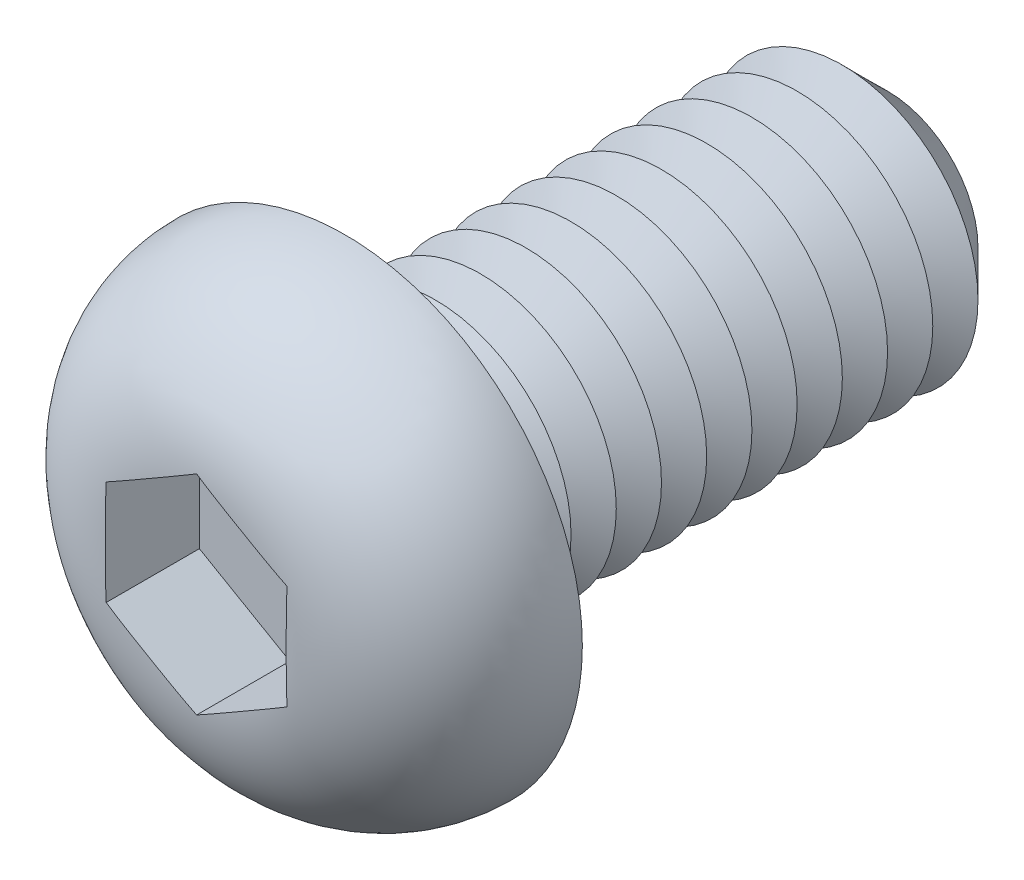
ISO-10303-21;
HEADER;
FILE_DESCRIPTION(('STEP AP214'),'2;1');
FILE_NAME('part.step','',(''),(''),'','','');
FILE_SCHEMA(('AUTOMOTIVE_DESIGN { 1 0 10303 214 1 1 1 1 }'));
ENDSEC;
DATA;
#1=APPLICATION_CONTEXT('core data for automotive mechanical design processes');
#2=APPLICATION_PROTOCOL_DEFINITION('international standard','automotive_design',2000,#1);
#3=PRODUCT_CONTEXT('',#1,'mechanical');
#4=PRODUCT('Part','Part','',(#3));
#5=PRODUCT_RELATED_PRODUCT_CATEGORY('part','',(#4));
#6=PRODUCT_DEFINITION_FORMATION('','',#4);
#7=PRODUCT_DEFINITION_CONTEXT('part definition',#1,'design');
#8=PRODUCT_DEFINITION('design','',#6,#7);
#9=PRODUCT_DEFINITION_SHAPE('','',#8);
#10=(LENGTH_UNIT() NAMED_UNIT(*) SI_UNIT(.MILLI.,.METRE.));
#11=(NAMED_UNIT(*) PLANE_ANGLE_UNIT() SI_UNIT($,.RADIAN.));
#12=(NAMED_UNIT(*) SI_UNIT($,.STERADIAN.) SOLID_ANGLE_UNIT());
#13=UNCERTAINTY_MEASURE_WITH_UNIT(LENGTH_MEASURE(1.E-05),#10,'distance_accuracy_value','');
#14=(GEOMETRIC_REPRESENTATION_CONTEXT(3) GLOBAL_UNCERTAINTY_ASSIGNED_CONTEXT((#13)) GLOBAL_UNIT_ASSIGNED_CONTEXT((#10,
#11,#12)) REPRESENTATION_CONTEXT('',''));
#15=CARTESIAN_POINT('',(0.,0.,0.));
#16=DIRECTION('',(0.,0.,1.));
#17=DIRECTION('',(1.,0.,0.));
#18=AXIS2_PLACEMENT_3D('',#15,#16,#17);
#19=CARTESIAN_POINT('',(0.,0.,-12.));
#20=DIRECTION('',(0.,0.,1.));
#21=DIRECTION('',(1.,0.,0.));
#22=AXIS2_PLACEMENT_3D('',#19,#20,#21);
#23=CYLINDRICAL_SURFACE('',#22,3.);
#24=CARTESIAN_POINT('',(0.,0.,-0.5));
#25=DIRECTION('',(0.,0.,1.));
#26=DIRECTION('',(1.,0.,0.));
#27=AXIS2_PLACEMENT_3D('',#24,#25,#26);
#28=CIRCLE('',#27,3.);
#29=CARTESIAN_POINT('',(3.,0.,-0.5));
#30=VERTEX_POINT('',#29);
#31=EDGE_CURVE('E48',#30,#30,#28,.F.);
#32=ORIENTED_EDGE('',*,*,#31,.T.);
#33=EDGE_LOOP('',(#32));
#34=FACE_BOUND('',#33,.T.);
#35=CARTESIAN_POINT('',(0.,0.,-1.));
#36=DIRECTION('',(0.,0.,1.));
#37=DIRECTION('',(1.,0.,0.));
#38=AXIS2_PLACEMENT_3D('',#35,#36,#37);
#39=CIRCLE('',#38,3.);
#40=CARTESIAN_POINT('',(3.,0.,-1.));
#41=VERTEX_POINT('',#40);
#42=EDGE_CURVE('E118',#41,#41,#39,.T.);
#43=ORIENTED_EDGE('',*,*,#42,.T.);
#44=EDGE_LOOP('',(#43));
#45=FACE_BOUND('',#44,.T.);
#46=ADVANCED_FACE('F39',(#34,#45),#23,.T.);
#47=CARTESIAN_POINT('',(0.,5.25,0.));
#48=DIRECTION('',(0.,0.,1.));
#49=DIRECTION('',(1.,0.,0.));
#50=AXIS2_PLACEMENT_3D('',#47,#48,#49);
#51=PLANE('',#50);
#52=CARTESIAN_POINT('',(0.,0.,0.));
#53=DIRECTION('',(0.,0.,1.));
#54=DIRECTION('',(1.,0.,0.));
#55=AXIS2_PLACEMENT_3D('',#52,#53,#54);
#56=CIRCLE('',#55,3.5);
#57=CARTESIAN_POINT('',(3.5,0.,0.));
#58=VERTEX_POINT('',#57);
#59=EDGE_CURVE('E11',#58,#58,#56,.T.);
#60=ORIENTED_EDGE('',*,*,#59,.T.);
#61=EDGE_LOOP('',(#60));
#62=FACE_BOUND('',#61,.T.);
#63=CARTESIAN_POINT('',(0.,0.,0.));
#64=DIRECTION('',(0.,0.,1.));
#65=DIRECTION('',(1.,0.,0.));
#66=AXIS2_PLACEMENT_3D('',#63,#64,#65);
#67=CIRCLE('',#66,5.25);
#68=CARTESIAN_POINT('',(5.25,0.,0.));
#69=VERTEX_POINT('',#68);
#70=EDGE_CURVE('E141',#69,#69,#67,.T.);
#71=ORIENTED_EDGE('',*,*,#70,.F.);
#72=EDGE_LOOP('',(#71));
#73=FACE_BOUND('',#72,.T.);
#74=ADVANCED_FACE('F217',(#62,#73),#51,.F.);
#75=CARTESIAN_POINT('',(0.,0.,0.));
#76=DIRECTION('',(0.,0.,1.));
#77=DIRECTION('',(1.,0.,0.));
#78=AXIS2_PLACEMENT_3D('',#75,#76,#77);
#79=DEGENERATE_TOROIDAL_SURFACE('',#78,1.95,3.3,.T.);
#80=CARTESIAN_POINT('',(-2.0002,1.15458506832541,3.28035788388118));
#81=CARTESIAN_POINT('',(-1.91691288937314,1.20267090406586,3.28561413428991));
#82=CARTESIAN_POINT('',(-1.83357497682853,1.25078607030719,3.2893341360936));
#83=CARTESIAN_POINT('',(-1.66686712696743,1.34703489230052,3.29467873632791));
#84=CARTESIAN_POINT('',(-1.58349720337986,1.39516854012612,3.29630387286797));
#85=CARTESIAN_POINT('',(-1.4167768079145,1.49142460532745,3.29843721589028));
#86=CARTESIAN_POINT('',(-1.33342633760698,1.53954702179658,3.29894575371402));
#87=CARTESIAN_POINT('',(-1.16671724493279,1.63579656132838,3.29953775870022));
#88=CARTESIAN_POINT('',(-1.0833586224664,1.68392368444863,3.29962119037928));
#89=CARTESIAN_POINT('',(-0.916641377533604,1.78017793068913,3.29962119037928));
#90=CARTESIAN_POINT('',(-0.833282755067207,1.82830505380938,3.29953775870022));
#91=CARTESIAN_POINT('',(-0.666573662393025,1.92455459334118,3.29894575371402));
#92=CARTESIAN_POINT('',(-0.5832231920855,1.97267700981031,3.29843721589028));
#93=CARTESIAN_POINT('',(-0.416502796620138,2.06893307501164,3.29630387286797));
#94=CARTESIAN_POINT('',(-0.333132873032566,2.11706672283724,3.29467873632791));
#95=CARTESIAN_POINT('',(-0.166425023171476,2.21331554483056,3.2893341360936));
#96=CARTESIAN_POINT('',(-0.083087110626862,2.2614307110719,3.28561413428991));
#97=CARTESIAN_POINT('',(0.000200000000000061,2.30951654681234,3.28035788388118));
#98=B_SPLINE_CURVE_WITH_KNOTS('',3,(#80,#81,#82,#83,#84,#85,#86,#87,#88,#89,#90,#91,#92,#93,#94,
#95,#96,#97),.UNSPECIFIED.,.F.,.F.,(4,2,2,2,2,2,2,2,4),(0.,0.288898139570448,0.577722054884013,
0.866460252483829,1.15522255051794,1.44398484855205,1.73272304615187,2.02154696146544,
2.31044510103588),.UNSPECIFIED.);
#99=CARTESIAN_POINT('',(-2.,1.15470053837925,3.28037053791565));
#100=VERTEX_POINT('',#99);
#101=CARTESIAN_POINT('',(0.,2.3094010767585,3.28037053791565));
#102=VERTEX_POINT('',#101);
#103=EDGE_CURVE('E157',#100,#102,#98,.T.);
#104=ORIENTED_EDGE('',*,*,#103,.T.);
#105=CARTESIAN_POINT('',(-0.000199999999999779,2.30951654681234,3.28035788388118));
#106=CARTESIAN_POINT('',(0.0830871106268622,2.2614307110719,3.28561413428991));
#107=CARTESIAN_POINT('',(0.166425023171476,2.21331554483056,3.2893341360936));
#108=CARTESIAN_POINT('',(0.333132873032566,2.11706672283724,3.29467873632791));
#109=CARTESIAN_POINT('',(0.416502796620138,2.06893307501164,3.29630387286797));
#110=CARTESIAN_POINT('',(0.5832231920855,1.97267700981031,3.29843721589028));
#111=CARTESIAN_POINT('',(0.666573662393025,1.92455459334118,3.29894575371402));
#112=CARTESIAN_POINT('',(0.833282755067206,1.82830505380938,3.29953775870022));
#113=CARTESIAN_POINT('',(0.916641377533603,1.78017793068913,3.29962119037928));
#114=CARTESIAN_POINT('',(1.0833586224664,1.68392368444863,3.29962119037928));
#115=CARTESIAN_POINT('',(1.16671724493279,1.63579656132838,3.29953775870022));
#116=CARTESIAN_POINT('',(1.33342633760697,1.53954702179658,3.29894575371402));
#117=CARTESIAN_POINT('',(1.4167768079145,1.49142460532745,3.29843721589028));
#118=CARTESIAN_POINT('',(1.58349720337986,1.39516854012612,3.29630387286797));
#119=CARTESIAN_POINT('',(1.66686712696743,1.34703489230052,3.29467873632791));
#120=CARTESIAN_POINT('',(1.83357497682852,1.25078607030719,3.2893341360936));
#121=CARTESIAN_POINT('',(1.91691288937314,1.20267090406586,3.28561413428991));
#122=CARTESIAN_POINT('',(2.0002,1.15458506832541,3.28035788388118));
#123=B_SPLINE_CURVE_WITH_KNOTS('',3,(#105,#106,#107,#108,#109,#110,#111,#112,#113,#114,#115,
#116,#117,#118,#119,#120,#121,#122),.UNSPECIFIED.,.F.,.F.,(4,2,2,2,2,2,2,2,4),(0.,
0.288898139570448,0.577722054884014,0.866460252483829,1.15522255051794,1.44398484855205,
1.73272304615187,2.02154696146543,2.31044510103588),.UNSPECIFIED.);
#124=CARTESIAN_POINT('',(2.,1.15470053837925,3.28037053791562));
#125=VERTEX_POINT('',#124);
#126=EDGE_CURVE('E98',#102,#125,#123,.T.);
#127=ORIENTED_EDGE('',*,*,#126,.T.);
#128=CARTESIAN_POINT('',(2.,0.,3.29962119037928));
#129=CARTESIAN_POINT('',(2.,-0.083776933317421,3.29962202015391));
#130=CARTESIAN_POINT('',(2.,-0.16755385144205,3.29955399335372));
#131=CARTESIAN_POINT('',(2.,-0.335108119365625,3.29913665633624));
#132=CARTESIAN_POINT('',(2.,-0.418885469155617,3.29878734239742));
#133=CARTESIAN_POINT('',(2.,-0.58647412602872,3.29739645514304));
#134=CARTESIAN_POINT('',(2.,-0.670285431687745,3.29635457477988));
#135=CARTESIAN_POINT('',(2.,-0.83788107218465,3.29299045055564));
#136=CARTESIAN_POINT('',(2.,-0.921665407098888,3.29066821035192));
#137=CARTESIAN_POINT('',(2.,-1.1722454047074,3.2807858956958));
#138=CARTESIAN_POINT('',(2.,-1.33895832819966,3.27031526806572));
#139=CARTESIAN_POINT('',(2.,-1.67103623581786,3.23635494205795));
#140=CARTESIAN_POINT('',(2.,-1.83640244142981,3.21287879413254));
#141=CARTESIAN_POINT('',(2.,-2.10344176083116,3.16074182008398));
#142=CARTESIAN_POINT('',(2.,-2.2061099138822,3.13718731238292));
#143=CARTESIAN_POINT('',(2.,-2.40948794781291,3.08263206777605));
#144=CARTESIAN_POINT('',(2.,-2.51019754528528,3.05163026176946));
#145=CARTESIAN_POINT('',(2.,-2.70894468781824,2.98167613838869));
#146=CARTESIAN_POINT('',(2.,-2.80697949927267,2.94271600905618));
#147=CARTESIAN_POINT('',(2.,-2.9994014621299,2.85662314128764));
#148=CARTESIAN_POINT('',(2.,-3.09378880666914,2.80949083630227));
#149=CARTESIAN_POINT('',(2.,-3.27874879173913,2.70660110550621));
#150=CARTESIAN_POINT('',(2.,-3.36928473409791,2.6507774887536));
#151=CARTESIAN_POINT('',(2.,-3.54476824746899,2.53095107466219));
#152=CARTESIAN_POINT('',(2.,-3.6297163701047,2.46694908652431));
#153=CARTESIAN_POINT('',(2.,-3.79309021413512,2.33110056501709));
#154=CARTESIAN_POINT('',(2.,-3.87151694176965,2.25925524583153));
#155=CARTESIAN_POINT('',(2.,-4.02093628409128,2.10826339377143));
#156=CARTESIAN_POINT('',(2.,-4.09192987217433,2.02911781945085));
#157=CARTESIAN_POINT('',(2.,-4.27732278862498,1.8003635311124));
#158=CARTESIAN_POINT('',(2.,-4.38297261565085,1.64348590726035));
#159=CARTESIAN_POINT('',(2.,-4.564185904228,1.31336862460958));
#160=CARTESIAN_POINT('',(2.,-4.63976443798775,1.14013721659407));
#161=CARTESIAN_POINT('',(2.,-4.75417820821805,0.794488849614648));
#162=CARTESIAN_POINT('',(2.,-4.79509243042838,0.622758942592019));
#163=CARTESIAN_POINT('',(2.,-4.84679751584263,0.274828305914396));
#164=CARTESIAN_POINT('',(2.,-4.85759267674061,0.098628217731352));
#165=CARTESIAN_POINT('',(2.,-4.8487955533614,-0.249157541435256));
#166=CARTESIAN_POINT('',(2.,-4.82985906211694,-0.420760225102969));
#167=CARTESIAN_POINT('',(2.,-4.76345103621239,-0.758322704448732));
#168=CARTESIAN_POINT('',(2.,-4.71598351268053,-0.924283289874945));
#169=CARTESIAN_POINT('',(2.,-4.59404942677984,-1.24604183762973));
#170=CARTESIAN_POINT('',(2.,-4.51956988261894,-1.40183487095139));
#171=CARTESIAN_POINT('',(2.,-4.34600859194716,-1.6990817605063));
#172=CARTESIAN_POINT('',(2.,-4.24691988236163,-1.84053154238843));
#173=CARTESIAN_POINT('',(2.,-4.02493220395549,-2.10847549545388));
#174=CARTESIAN_POINT('',(2.,-3.90156532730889,-2.23458080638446));
#175=CARTESIAN_POINT('',(2.,-3.63636218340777,-2.46550695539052));
#176=CARTESIAN_POINT('',(2.,-3.49453117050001,-2.57033382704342));
#177=CARTESIAN_POINT('',(2.,-3.26713798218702,-2.7130834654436));
#178=CARTESIAN_POINT('',(2.,-3.18660091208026,-2.75923686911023));
#179=CARTESIAN_POINT('',(2.,-3.02216370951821,-2.84520816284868));
#180=CARTESIAN_POINT('',(2.,-2.93826250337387,-2.88502400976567));
#181=CARTESIAN_POINT('',(2.,-2.76779132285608,-2.95832456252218));
#182=CARTESIAN_POINT('',(2.,-2.68122238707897,-2.99181169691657));
#183=CARTESIAN_POINT('',(2.,-2.50604626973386,-3.05263810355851));
#184=CARTESIAN_POINT('',(2.,-2.41744088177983,-3.07998257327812));
#185=CARTESIAN_POINT('',(2.,-2.20396420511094,-3.13835394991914));
#186=CARTESIAN_POINT('',(2.,-2.07835656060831,-3.16669536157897));
#187=CARTESIAN_POINT('',(2.,-1.82529007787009,-3.2134938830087));
#188=CARTESIAN_POINT('',(2.,-1.69783012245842,-3.23194474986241));
#189=CARTESIAN_POINT('',(2.,-1.44149598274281,-3.26083645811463));
#190=CARTESIAN_POINT('',(2.,-1.31261808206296,-3.27124272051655));
#191=CARTESIAN_POINT('',(2.,-1.05456848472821,-3.28623769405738));
#192=CARTESIAN_POINT('',(2.,-0.925396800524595,-3.29082664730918));
#193=CARTESIAN_POINT('',(2.,-0.665550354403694,-3.29674923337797));
#194=CARTESIAN_POINT('',(2.,-0.53487497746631,-3.29804579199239));
#195=CARTESIAN_POINT('',(2.,-0.273526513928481,-3.29947536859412));
#196=CARTESIAN_POINT('',(2.,-0.142853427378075,-3.29960842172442));
#197=CARTESIAN_POINT('',(2.,0.118243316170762,-3.29963281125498));
#198=CARTESIAN_POINT('',(2.,0.248666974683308,-3.29952460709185));
#199=CARTESIAN_POINT('',(2.,0.509509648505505,-3.29825409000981));
#200=CARTESIAN_POINT('',(2.,0.639928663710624,-3.29709183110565));
#201=CARTESIAN_POINT('',(2.,0.831730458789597,-3.29304171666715));
#202=CARTESIAN_POINT('',(2.,0.89313616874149,-3.29139197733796));
#203=CARTESIAN_POINT('',(2.,1.01591282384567,-3.28711504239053));
#204=CARTESIAN_POINT('',(2.,1.07728376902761,-3.28448784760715));
#205=CARTESIAN_POINT('',(2.,1.26131335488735,-3.27473407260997));
#206=CARTESIAN_POINT('',(2.,1.38388698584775,-3.2657353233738));
#207=CARTESIAN_POINT('',(2.,1.62750125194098,-3.24079239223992));
#208=CARTESIAN_POINT('',(2.,1.74854662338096,-3.22489680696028));
#209=CARTESIAN_POINT('',(2.,1.98924449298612,-3.18452451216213));
#210=CARTESIAN_POINT('',(2.,2.10889688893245,-3.16004717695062));
#211=CARTESIAN_POINT('',(2.,2.34827145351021,-3.10067973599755));
#212=CARTESIAN_POINT('',(2.,2.46794336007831,-3.06558373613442));
#213=CARTESIAN_POINT('',(2.,2.70350765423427,-2.98433995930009));
#214=CARTESIAN_POINT('',(2.,2.8194000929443,-2.9381923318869));
#215=CARTESIAN_POINT('',(2.,3.0462872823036,-2.83430045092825));
#216=CARTESIAN_POINT('',(2.,3.157267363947,-2.77652399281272));
#217=CARTESIAN_POINT('',(2.,3.37244069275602,-2.64945989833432));
#218=CARTESIAN_POINT('',(2.,3.47663511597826,-2.58017426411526));
#219=CARTESIAN_POINT('',(2.,3.66184410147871,-2.44158969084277));
#220=CARTESIAN_POINT('',(2.,3.74400419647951,-2.37381785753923));
#221=CARTESIAN_POINT('',(2.,3.90136233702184,-2.23063102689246));
#222=CARTESIAN_POINT('',(2.,3.9765614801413,-2.1552172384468));
#223=CARTESIAN_POINT('',(2.,4.11902811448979,-1.99742327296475));
#224=CARTESIAN_POINT('',(2.,4.18630715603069,-1.91505354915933));
#225=CARTESIAN_POINT('',(2.,4.31224227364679,-1.74401295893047));
#226=CARTESIAN_POINT('',(2.,4.37089943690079,-1.65534288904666));
#227=CARTESIAN_POINT('',(2.,4.51742320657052,-1.40720395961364));
#228=CARTESIAN_POINT('',(2.,4.59632371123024,-1.24230503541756));
#229=CARTESIAN_POINT('',(2.,4.72377654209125,-0.901269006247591));
#230=CARTESIAN_POINT('',(2.,4.77233626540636,-0.725134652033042));
#231=CARTESIAN_POINT('',(2.,4.83594291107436,-0.375162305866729));
#232=CARTESIAN_POINT('',(2.,4.85240855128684,-0.201581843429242));
#233=CARTESIAN_POINT('',(2.,4.85558073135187,0.145835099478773));
#234=CARTESIAN_POINT('',(2.,4.8422910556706,0.319671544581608));
#235=CARTESIAN_POINT('',(2.,4.78674180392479,0.660539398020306));
#236=CARTESIAN_POINT('',(2.,4.74482430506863,0.827626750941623));
#237=CARTESIAN_POINT('',(2.,4.63375789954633,1.15246461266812));
#238=CARTESIAN_POINT('',(2.,4.56461058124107,1.31021566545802));
#239=CARTESIAN_POINT('',(2.,4.40063624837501,1.61344814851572));
#240=CARTESIAN_POINT('',(2.,4.30559842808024,1.75881539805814));
#241=CARTESIAN_POINT('',(2.,4.09315528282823,2.03216183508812));
#242=CARTESIAN_POINT('',(2.,3.97574503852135,2.16013718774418));
#243=CARTESIAN_POINT('',(2.,3.71810418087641,2.3997527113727));
#244=CARTESIAN_POINT('',(2.,3.57725563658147,2.51072635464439));
#245=CARTESIAN_POINT('',(2.,3.28005668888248,2.70933274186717));
#246=CARTESIAN_POINT('',(2.,3.12370896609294,2.79696951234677));
#247=CARTESIAN_POINT('',(2.,2.85462284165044,2.92305372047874));
#248=CARTESIAN_POINT('',(2.,2.74490899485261,2.96813077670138));
#249=CARTESIAN_POINT('',(2.,2.52184151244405,3.04824715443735));
#250=CARTESIAN_POINT('',(2.,2.40848685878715,3.08328364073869));
#251=CARTESIAN_POINT('',(2.,2.17918323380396,3.14397693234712));
#252=CARTESIAN_POINT('',(2.,2.06323128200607,3.16962230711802));
#253=CARTESIAN_POINT('',(2.,1.82982653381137,3.21251895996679));
#254=CARTESIAN_POINT('',(2.,1.71237385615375,3.229770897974));
#255=CARTESIAN_POINT('',(2.,1.46252543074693,3.2589582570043));
#256=CARTESIAN_POINT('',(2.,1.3300298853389,3.27000580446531));
#257=CARTESIAN_POINT('',(2.,1.0646774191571,3.28585371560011));
#258=CARTESIAN_POINT('',(2.,0.931820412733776,3.29065244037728));
#259=CARTESIAN_POINT('',(2.,0.665789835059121,3.29677132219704));
#260=CARTESIAN_POINT('',(2.,0.532616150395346,3.29808470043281));
#261=CARTESIAN_POINT('',(2.,0.332868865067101,3.29913679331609));
#262=CARTESIAN_POINT('',(2.,0.266295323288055,3.2993345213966));
#263=CARTESIAN_POINT('',(2.,0.133147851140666,3.29957639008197));
#264=CARTESIAN_POINT('',(2.,0.0665739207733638,3.29962053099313));
#265=CARTESIAN_POINT('',(2.,0.,3.29962119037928));
#266=B_SPLINE_CURVE_WITH_KNOTS('',3,(#128,#129,#130,#131,#132,#133,#134,#135,#136,#137,#138,
#139,#140,#141,#142,#143,#144,#145,#146,#147,#148,#149,#150,#151,#152,#153,#154,#155,#156,#157,
#158,#159,#160,#161,#162,#163,#164,#165,#166,#167,#168,#169,#170,#171,#172,#173,#174,#175,#176,
#177,#178,#179,#180,#181,#182,#183,#184,#185,#186,#187,#188,#189,#190,#191,#192,#193,#194,#195,
#196,#197,#198,#199,#200,#201,#202,#203,#204,#205,#206,#207,#208,#209,#210,#211,#212,#213,#214,
#215,#216,#217,#218,#219,#220,#221,#222,#223,#224,#225,#226,#227,#228,#229,#230,#231,#232,#233,
#234,#235,#236,#237,#238,#239,#240,#241,#242,#243,#244,#245,#246,#247,#248,#249,#250,#251,#252,
#253,#254,#255,#256,#257,#258,#259,#260,#261,#262,#263,#264,#265),.UNSPECIFIED.,.T.,.F.,(4,2,2,
2,2,2,2,2,2,2,2,2,2,2,2,2,2,2,2,2,2,2,2,2,2,2,2,2,2,2,2,2,2,2,2,2,2,2,2,2,2,2,2,2,2,2,2,2,2,2,2,
2,2,2,2,2,2,2,2,2,2,2,2,2,2,2,2,2,4),(0.,0.251330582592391,0.502664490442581,0.754109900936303,
1.00555459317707,1.50637447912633,2.00667353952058,2.32243701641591,2.63824585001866,
2.95436618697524,3.27046976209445,3.58911045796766,3.90771965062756,4.22627959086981,
4.5447977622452,5.10896009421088,5.67283930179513,6.19985685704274,6.72679920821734,
7.24228104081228,7.75769041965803,8.27334782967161,8.78915130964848,9.3160918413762,
9.84288274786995,10.1211212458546,10.3994492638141,10.6776702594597,10.9556549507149,
11.3414617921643,11.727511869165,12.1152122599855,12.5028965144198,12.8949273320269,
13.2869463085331,13.6782193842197,14.0694724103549,14.2537488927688,14.4380252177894,
14.8065831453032,15.1725852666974,15.5386140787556,15.9122523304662,16.28588552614,
16.6605680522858,17.0351854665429,17.3542226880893,17.6732095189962,17.9917252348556,
18.3102007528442,18.8555909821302,19.4008481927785,19.9214008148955,20.4418872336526,
20.9562606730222,21.4706041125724,21.9892675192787,22.5080451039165,23.0436926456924,
23.5792477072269,23.9346277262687,24.2901079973,24.6460195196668,25.0019030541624,
25.4005476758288,25.7992968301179,26.1988209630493,26.3985429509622,26.5982645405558),.UNSPECIFIED.);
#267=CARTESIAN_POINT('',(2.,-1.15470053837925,3.28037053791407));
#268=VERTEX_POINT('',#267);
#269=EDGE_CURVE('E63',#125,#268,#266,.T.);
#270=ORIENTED_EDGE('',*,*,#269,.T.);
#271=CARTESIAN_POINT('',(2.0002,-1.15458506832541,3.28035788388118));
#272=CARTESIAN_POINT('',(1.91691288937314,-1.20267090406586,3.28561413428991));
#273=CARTESIAN_POINT('',(1.83357497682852,-1.25078607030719,3.2893341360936));
#274=CARTESIAN_POINT('',(1.66686712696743,-1.34703489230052,3.29467873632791));
#275=CARTESIAN_POINT('',(1.58349720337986,-1.39516854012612,3.29630387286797));
#276=CARTESIAN_POINT('',(1.4167768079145,-1.49142460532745,3.29843721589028));
#277=CARTESIAN_POINT('',(1.33342633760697,-1.53954702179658,3.29894575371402));
#278=CARTESIAN_POINT('',(1.16671724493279,-1.63579656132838,3.29953775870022));
#279=CARTESIAN_POINT('',(1.0833586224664,-1.68392368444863,3.29962119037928));
#280=CARTESIAN_POINT('',(0.916641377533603,-1.78017793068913,3.29962119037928));
#281=CARTESIAN_POINT('',(0.833282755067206,-1.82830505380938,3.29953775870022));
#282=CARTESIAN_POINT('',(0.666573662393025,-1.92455459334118,3.29894575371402));
#283=CARTESIAN_POINT('',(0.5832231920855,-1.97267700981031,3.29843721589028));
#284=CARTESIAN_POINT('',(0.416502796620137,-2.06893307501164,3.29630387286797));
#285=CARTESIAN_POINT('',(0.333132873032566,-2.11706672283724,3.29467873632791));
#286=CARTESIAN_POINT('',(0.166425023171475,-2.21331554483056,3.2893341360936));
#287=CARTESIAN_POINT('',(0.0830871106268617,-2.2614307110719,3.28561413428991));
#288=CARTESIAN_POINT('',(-0.000200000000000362,-2.30951654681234,3.28035788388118));
#289=B_SPLINE_CURVE_WITH_KNOTS('',3,(#271,#272,#273,#274,#275,#276,#277,#278,#279,#280,#281,
#282,#283,#284,#285,#286,#287,#288),.UNSPECIFIED.,.F.,.F.,(4,2,2,2,2,2,2,2,4),(0.,
0.288898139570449,0.577722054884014,0.86646025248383,1.15522255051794,1.44398484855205,
1.73272304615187,2.02154696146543,2.31044510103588),.UNSPECIFIED.);
#290=CARTESIAN_POINT('',(0.,-2.3094010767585,3.28037053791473));
#291=VERTEX_POINT('',#290);
#292=EDGE_CURVE('E238',#268,#291,#289,.T.);
#293=ORIENTED_EDGE('',*,*,#292,.T.);
#294=CARTESIAN_POINT('',(0.000199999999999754,-2.30951654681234,3.28035788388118));
#295=CARTESIAN_POINT('',(-0.0830871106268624,-2.2614307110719,3.28561413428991));
#296=CARTESIAN_POINT('',(-0.166425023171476,-2.21331554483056,3.2893341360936));
#297=CARTESIAN_POINT('',(-0.333132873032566,-2.11706672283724,3.29467873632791));
#298=CARTESIAN_POINT('',(-0.416502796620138,-2.06893307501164,3.29630387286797));
#299=CARTESIAN_POINT('',(-0.5832231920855,-1.97267700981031,3.29843721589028));
#300=CARTESIAN_POINT('',(-0.666573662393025,-1.92455459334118,3.29894575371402));
#301=CARTESIAN_POINT('',(-0.833282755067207,-1.82830505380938,3.29953775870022));
#302=CARTESIAN_POINT('',(-0.916641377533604,-1.78017793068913,3.29962119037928));
#303=CARTESIAN_POINT('',(-1.0833586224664,-1.68392368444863,3.29962119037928));
#304=CARTESIAN_POINT('',(-1.16671724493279,-1.63579656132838,3.29953775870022));
#305=CARTESIAN_POINT('',(-1.33342633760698,-1.53954702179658,3.29894575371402));
#306=CARTESIAN_POINT('',(-1.4167768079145,-1.49142460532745,3.29843721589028));
#307=CARTESIAN_POINT('',(-1.58349720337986,-1.39516854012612,3.29630387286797));
#308=CARTESIAN_POINT('',(-1.66686712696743,-1.34703489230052,3.29467873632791));
#309=CARTESIAN_POINT('',(-1.83357497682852,-1.25078607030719,3.2893341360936));
#310=CARTESIAN_POINT('',(-1.91691288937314,-1.20267090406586,3.28561413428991));
#311=CARTESIAN_POINT('',(-2.0002,-1.15458506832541,3.28035788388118));
#312=B_SPLINE_CURVE_WITH_KNOTS('',3,(#294,#295,#296,#297,#298,#299,#300,#301,#302,#303,#304,
#305,#306,#307,#308,#309,#310,#311),.UNSPECIFIED.,.F.,.F.,(4,2,2,2,2,2,2,2,4),(0.,
0.288898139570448,0.577722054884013,0.866460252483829,1.15522255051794,1.44398484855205,
1.73272304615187,2.02154696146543,2.31044510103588),.UNSPECIFIED.);
#313=CARTESIAN_POINT('',(-2.,-1.15470053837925,3.28037053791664));
#314=VERTEX_POINT('',#313);
#315=EDGE_CURVE('E244',#291,#314,#312,.T.);
#316=ORIENTED_EDGE('',*,*,#315,.T.);
#317=CARTESIAN_POINT('',(-2.,0.,3.29962119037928));
#318=CARTESIAN_POINT('',(-2.,0.083776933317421,3.29962202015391));
#319=CARTESIAN_POINT('',(-2.,0.16755385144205,3.29955399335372));
#320=CARTESIAN_POINT('',(-2.,0.335108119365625,3.29913665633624));
#321=CARTESIAN_POINT('',(-2.,0.418885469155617,3.29878734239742));
#322=CARTESIAN_POINT('',(-2.,0.58647412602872,3.29739645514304));
#323=CARTESIAN_POINT('',(-2.,0.670285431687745,3.29635457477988));
#324=CARTESIAN_POINT('',(-2.,0.83788107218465,3.29299045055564));
#325=CARTESIAN_POINT('',(-2.,0.921665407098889,3.29066821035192));
#326=CARTESIAN_POINT('',(-2.,1.1722454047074,3.2807858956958));
#327=CARTESIAN_POINT('',(-2.,1.33895832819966,3.27031526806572));
#328=CARTESIAN_POINT('',(-2.,1.67103623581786,3.23635494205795));
#329=CARTESIAN_POINT('',(-2.,1.83640244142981,3.21287879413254));
#330=CARTESIAN_POINT('',(-2.,2.10344176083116,3.16074182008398));
#331=CARTESIAN_POINT('',(-2.,2.2061099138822,3.13718731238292));
#332=CARTESIAN_POINT('',(-2.,2.40948794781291,3.08263206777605));
#333=CARTESIAN_POINT('',(-2.,2.51019754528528,3.05163026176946));
#334=CARTESIAN_POINT('',(-2.,2.70894468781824,2.98167613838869));
#335=CARTESIAN_POINT('',(-2.,2.80697949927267,2.94271600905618));
#336=CARTESIAN_POINT('',(-2.,2.9994014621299,2.85662314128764));
#337=CARTESIAN_POINT('',(-2.,3.09378880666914,2.80949083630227));
#338=CARTESIAN_POINT('',(-2.,3.27874879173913,2.70660110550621));
#339=CARTESIAN_POINT('',(-2.,3.36928473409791,2.6507774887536));
#340=CARTESIAN_POINT('',(-2.,3.54476824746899,2.53095107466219));
#341=CARTESIAN_POINT('',(-2.,3.6297163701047,2.46694908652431));
#342=CARTESIAN_POINT('',(-2.,3.79309021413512,2.33110056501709));
#343=CARTESIAN_POINT('',(-2.,3.87151694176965,2.25925524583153));
#344=CARTESIAN_POINT('',(-2.,4.02093628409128,2.10826339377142));
#345=CARTESIAN_POINT('',(-2.,4.09192987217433,2.02911781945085));
#346=CARTESIAN_POINT('',(-2.,4.27732278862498,1.8003635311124));
#347=CARTESIAN_POINT('',(-2.,4.38297261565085,1.64348590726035));
#348=CARTESIAN_POINT('',(-2.,4.564185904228,1.31336862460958));
#349=CARTESIAN_POINT('',(-2.,4.63976443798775,1.14013721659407));
#350=CARTESIAN_POINT('',(-2.,4.75417820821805,0.794488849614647));
#351=CARTESIAN_POINT('',(-2.,4.79509243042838,0.622758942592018));
#352=CARTESIAN_POINT('',(-2.,4.84679751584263,0.274828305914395));
#353=CARTESIAN_POINT('',(-2.,4.85759267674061,0.0986282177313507));
#354=CARTESIAN_POINT('',(-2.,4.8487955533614,-0.249157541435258));
#355=CARTESIAN_POINT('',(-2.,4.82985906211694,-0.42076022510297));
#356=CARTESIAN_POINT('',(-2.,4.76345103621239,-0.758322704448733));
#357=CARTESIAN_POINT('',(-2.,4.71598351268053,-0.924283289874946));
#358=CARTESIAN_POINT('',(-2.,4.59404942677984,-1.24604183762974));
#359=CARTESIAN_POINT('',(-2.,4.51956988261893,-1.40183487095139));
#360=CARTESIAN_POINT('',(-2.,4.34600859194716,-1.6990817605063));
#361=CARTESIAN_POINT('',(-2.,4.24691988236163,-1.84053154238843));
#362=CARTESIAN_POINT('',(-2.,4.02493220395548,-2.10847549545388));
#363=CARTESIAN_POINT('',(-2.,3.90156532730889,-2.23458080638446));
#364=CARTESIAN_POINT('',(-2.,3.63636218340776,-2.46550695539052));
#365=CARTESIAN_POINT('',(-2.,3.49453117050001,-2.57033382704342));
#366=CARTESIAN_POINT('',(-2.,3.26713798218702,-2.7130834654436));
#367=CARTESIAN_POINT('',(-2.,3.18660091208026,-2.75923686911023));
#368=CARTESIAN_POINT('',(-2.,3.02216370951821,-2.84520816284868));
#369=CARTESIAN_POINT('',(-2.,2.93826250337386,-2.88502400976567));
#370=CARTESIAN_POINT('',(-2.,2.76779132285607,-2.95832456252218));
#371=CARTESIAN_POINT('',(-2.,2.68122238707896,-2.99181169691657));
#372=CARTESIAN_POINT('',(-2.,2.50604626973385,-3.05263810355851));
#373=CARTESIAN_POINT('',(-2.,2.41744088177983,-3.07998257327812));
#374=CARTESIAN_POINT('',(-2.,2.20396420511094,-3.13835394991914));
#375=CARTESIAN_POINT('',(-2.,2.0783565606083,-3.16669536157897));
#376=CARTESIAN_POINT('',(-2.,1.82529007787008,-3.2134938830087));
#377=CARTESIAN_POINT('',(-2.,1.69783012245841,-3.23194474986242));
#378=CARTESIAN_POINT('',(-2.,1.4414959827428,-3.26083645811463));
#379=CARTESIAN_POINT('',(-2.,1.31261808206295,-3.27124272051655));
#380=CARTESIAN_POINT('',(-2.,1.0545684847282,-3.28623769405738));
#381=CARTESIAN_POINT('',(-2.,0.925396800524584,-3.29082664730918));
#382=CARTESIAN_POINT('',(-2.,0.665550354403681,-3.29674923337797));
#383=CARTESIAN_POINT('',(-2.,0.534874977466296,-3.29804579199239));
#384=CARTESIAN_POINT('',(-2.,0.273526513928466,-3.29947536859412));
#385=CARTESIAN_POINT('',(-2.,0.142853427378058,-3.29960842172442));
#386=CARTESIAN_POINT('',(-2.,-0.11824331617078,-3.29963281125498));
#387=CARTESIAN_POINT('',(-2.,-0.248666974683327,-3.29952460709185));
#388=CARTESIAN_POINT('',(-2.,-0.509509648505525,-3.29825409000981));
#389=CARTESIAN_POINT('',(-2.,-0.639928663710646,-3.29709183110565));
#390=CARTESIAN_POINT('',(-2.,-0.83173045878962,-3.29304171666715));
#391=CARTESIAN_POINT('',(-2.,-0.893136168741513,-3.29139197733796));
#392=CARTESIAN_POINT('',(-2.,-1.0159128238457,-3.28711504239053));
#393=CARTESIAN_POINT('',(-2.,-1.07728376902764,-3.28448784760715));
#394=CARTESIAN_POINT('',(-2.,-1.26131335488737,-3.27473407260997));
#395=CARTESIAN_POINT('',(-2.,-1.38388698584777,-3.2657353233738));
#396=CARTESIAN_POINT('',(-2.,-1.627501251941,-3.24079239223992));
#397=CARTESIAN_POINT('',(-2.,-1.74854662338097,-3.22489680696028));
#398=CARTESIAN_POINT('',(-2.,-1.98924449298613,-3.18452451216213));
#399=CARTESIAN_POINT('',(-2.,-2.10889688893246,-3.16004717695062));
#400=CARTESIAN_POINT('',(-2.,-2.34827145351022,-3.10067973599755));
#401=CARTESIAN_POINT('',(-2.,-2.46794336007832,-3.06558373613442));
#402=CARTESIAN_POINT('',(-2.,-2.70350765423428,-2.98433995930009));
#403=CARTESIAN_POINT('',(-2.,-2.81940009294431,-2.93819233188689));
#404=CARTESIAN_POINT('',(-2.,-3.0462872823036,-2.83430045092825));
#405=CARTESIAN_POINT('',(-2.,-3.157267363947,-2.77652399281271));
#406=CARTESIAN_POINT('',(-2.,-3.37244069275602,-2.64945989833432));
#407=CARTESIAN_POINT('',(-2.,-3.47663511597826,-2.58017426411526));
#408=CARTESIAN_POINT('',(-2.,-3.66184410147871,-2.44158969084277));
#409=CARTESIAN_POINT('',(-2.,-3.74400419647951,-2.37381785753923));
#410=CARTESIAN_POINT('',(-2.,-3.90136233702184,-2.23063102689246));
#411=CARTESIAN_POINT('',(-2.,-3.9765614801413,-2.1552172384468));
#412=CARTESIAN_POINT('',(-2.,-4.11902811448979,-1.99742327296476));
#413=CARTESIAN_POINT('',(-2.,-4.18630715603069,-1.91505354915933));
#414=CARTESIAN_POINT('',(-2.,-4.31224227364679,-1.74401295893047));
#415=CARTESIAN_POINT('',(-2.,-4.37089943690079,-1.65534288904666));
#416=CARTESIAN_POINT('',(-2.,-4.51742320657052,-1.40720395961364));
#417=CARTESIAN_POINT('',(-2.,-4.59632371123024,-1.24230503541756));
#418=CARTESIAN_POINT('',(-2.,-4.72377654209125,-0.901269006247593));
#419=CARTESIAN_POINT('',(-2.,-4.77233626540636,-0.725134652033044));
#420=CARTESIAN_POINT('',(-2.,-4.83594291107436,-0.37516230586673));
#421=CARTESIAN_POINT('',(-2.,-4.85240855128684,-0.201581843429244));
#422=CARTESIAN_POINT('',(-2.,-4.85558073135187,0.145835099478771));
#423=CARTESIAN_POINT('',(-2.,-4.8422910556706,0.319671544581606));
#424=CARTESIAN_POINT('',(-2.,-4.78674180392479,0.660539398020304));
#425=CARTESIAN_POINT('',(-2.,-4.74482430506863,0.827626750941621));
#426=CARTESIAN_POINT('',(-2.,-4.63375789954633,1.15246461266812));
#427=CARTESIAN_POINT('',(-2.,-4.56461058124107,1.31021566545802));
#428=CARTESIAN_POINT('',(-2.,-4.40063624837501,1.61344814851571));
#429=CARTESIAN_POINT('',(-2.,-4.30559842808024,1.75881539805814));
#430=CARTESIAN_POINT('',(-2.,-4.09315528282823,2.03216183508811));
#431=CARTESIAN_POINT('',(-2.,-3.97574503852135,2.16013718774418));
#432=CARTESIAN_POINT('',(-2.,-3.71810418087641,2.39975271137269));
#433=CARTESIAN_POINT('',(-2.,-3.57725563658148,2.51072635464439));
#434=CARTESIAN_POINT('',(-2.,-3.28005668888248,2.70933274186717));
#435=CARTESIAN_POINT('',(-2.,-3.12370896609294,2.79696951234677));
#436=CARTESIAN_POINT('',(-2.,-2.85462284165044,2.92305372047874));
#437=CARTESIAN_POINT('',(-2.,-2.74490899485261,2.96813077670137));
#438=CARTESIAN_POINT('',(-2.,-2.52184151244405,3.04824715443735));
#439=CARTESIAN_POINT('',(-2.,-2.40848685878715,3.08328364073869));
#440=CARTESIAN_POINT('',(-2.,-2.17918323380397,3.14397693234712));
#441=CARTESIAN_POINT('',(-2.,-2.06323128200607,3.16962230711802));
#442=CARTESIAN_POINT('',(-2.,-1.82982653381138,3.21251895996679));
#443=CARTESIAN_POINT('',(-2.,-1.71237385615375,3.229770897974));
#444=CARTESIAN_POINT('',(-2.,-1.46252543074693,3.2589582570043));
#445=CARTESIAN_POINT('',(-2.,-1.33002988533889,3.27000580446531));
#446=CARTESIAN_POINT('',(-2.,-1.0646774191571,3.28585371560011));
#447=CARTESIAN_POINT('',(-2.,-0.931820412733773,3.29065244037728));
#448=CARTESIAN_POINT('',(-2.,-0.66578983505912,3.29677132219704));
#449=CARTESIAN_POINT('',(-2.,-0.532616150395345,3.29808470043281));
#450=CARTESIAN_POINT('',(-2.,-0.332868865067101,3.29913679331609));
#451=CARTESIAN_POINT('',(-2.,-0.266295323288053,3.2993345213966));
#452=CARTESIAN_POINT('',(-2.,-0.133147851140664,3.29957639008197));
#453=CARTESIAN_POINT('',(-2.,-0.0665739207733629,3.29962053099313));
#454=CARTESIAN_POINT('',(-2.,0.,3.29962119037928));
#455=B_SPLINE_CURVE_WITH_KNOTS('',3,(#317,#318,#319,#320,#321,#322,#323,#324,#325,#326,#327,
#328,#329,#330,#331,#332,#333,#334,#335,#336,#337,#338,#339,#340,#341,#342,#343,#344,#345,#346,
#347,#348,#349,#350,#351,#352,#353,#354,#355,#356,#357,#358,#359,#360,#361,#362,#363,#364,#365,
#366,#367,#368,#369,#370,#371,#372,#373,#374,#375,#376,#377,#378,#379,#380,#381,#382,#383,#384,
#385,#386,#387,#388,#389,#390,#391,#392,#393,#394,#395,#396,#397,#398,#399,#400,#401,#402,#403,
#404,#405,#406,#407,#408,#409,#410,#411,#412,#413,#414,#415,#416,#417,#418,#419,#420,#421,#422,
#423,#424,#425,#426,#427,#428,#429,#430,#431,#432,#433,#434,#435,#436,#437,#438,#439,#440,#441,
#442,#443,#444,#445,#446,#447,#448,#449,#450,#451,#452,#453,#454),.UNSPECIFIED.,.T.,.F.,(4,2,2,
2,2,2,2,2,2,2,2,2,2,2,2,2,2,2,2,2,2,2,2,2,2,2,2,2,2,2,2,2,2,2,2,2,2,2,2,2,2,2,2,2,2,2,2,2,2,2,2,
2,2,2,2,2,2,2,2,2,2,2,2,2,2,2,2,2,4),(0.,0.251330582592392,0.502664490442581,0.754109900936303,
1.00555459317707,1.50637447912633,2.00667353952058,2.32243701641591,2.63824585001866,
2.95436618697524,3.27046976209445,3.58911045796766,3.90771965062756,4.22627959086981,
4.5447977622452,5.10896009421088,5.67283930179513,6.19985685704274,6.72679920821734,
7.24228104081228,7.75769041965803,8.27334782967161,8.78915130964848,9.3160918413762,
9.84288274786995,10.1211212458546,10.3994492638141,10.6776702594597,10.9556549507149,
11.3414617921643,11.727511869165,12.1152122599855,12.5028965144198,12.8949273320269,
13.2869463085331,13.6782193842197,14.0694724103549,14.2537488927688,14.4380252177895,
14.8065831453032,15.1725852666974,15.5386140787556,15.9122523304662,16.28588552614,
16.6605680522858,17.0351854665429,17.3542226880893,17.6732095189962,17.9917252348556,
18.3102007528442,18.8555909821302,19.4008481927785,19.9214008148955,20.4418872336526,
20.9562606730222,21.4706041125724,21.9892675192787,22.5080451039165,23.0436926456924,
23.5792477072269,23.9346277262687,24.2901079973,24.6460195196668,25.0019030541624,
25.4005476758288,25.7992968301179,26.1988209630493,26.3985429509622,26.5982645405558),.UNSPECIFIED.);
#456=EDGE_CURVE('E165',#314,#100,#455,.T.);
#457=ORIENTED_EDGE('',*,*,#456,.T.);
#458=EDGE_LOOP('',(#104,#127,#270,#293,#316,#457));
#459=FACE_BOUND('',#458,.T.);
#460=ORIENTED_EDGE('',*,*,#70,.T.);
#461=EDGE_LOOP('',(#460));
#462=FACE_BOUND('',#461,.T.);
#463=ADVANCED_FACE('F170',(#459,#462),#79,.T.);
#464=CARTESIAN_POINT('',(2.,1.15470053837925,1.22));
#465=DIRECTION('',(0.5,0.866025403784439,0.));
#466=DIRECTION('',(-0.866025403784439,0.5,0.));
#467=AXIS2_PLACEMENT_3D('',#464,#465,#466);
#468=PLANE('',#467);
#469=DIRECTION('',(0.,0.,1.));
#470=VECTOR('',#469,1.);
#471=CARTESIAN_POINT('',(0.,2.3094010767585,1.22));
#472=LINE('',#471,#470);
#473=CARTESIAN_POINT('',(0.,2.3094010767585,1.22));
#474=VERTEX_POINT('',#473);
#475=EDGE_CURVE('E55',#474,#102,#472,.T.);
#476=ORIENTED_EDGE('',*,*,#475,.F.);
#477=DIRECTION('',(-0.866025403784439,0.5,0.));
#478=VECTOR('',#477,1.);
#479=CARTESIAN_POINT('',(2.,1.15470053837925,1.22));
#480=LINE('',#479,#478);
#481=CARTESIAN_POINT('',(2.,1.15470053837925,1.22));
#482=VERTEX_POINT('',#481);
#483=EDGE_CURVE('E95',#482,#474,#480,.T.);
#484=ORIENTED_EDGE('',*,*,#483,.F.);
#485=DIRECTION('',(0.,0.,1.));
#486=VECTOR('',#485,1.);
#487=CARTESIAN_POINT('',(2.,1.15470053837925,1.22));
#488=LINE('',#487,#486);
#489=EDGE_CURVE('E138',#482,#125,#488,.T.);
#490=ORIENTED_EDGE('',*,*,#489,.T.);
#491=ORIENTED_EDGE('',*,*,#126,.F.);
#492=EDGE_LOOP('',(#476,#484,#490,#491));
#493=FACE_BOUND('',#492,.T.);
#494=ADVANCED_FACE('F93',(#493),#468,.F.);
#495=CARTESIAN_POINT('',(2.,-1.15470053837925,1.22));
#496=DIRECTION('',(1.,0.,0.));
#497=DIRECTION('',(0.,1.,0.));
#498=AXIS2_PLACEMENT_3D('',#495,#496,#497);
#499=PLANE('',#498);
#500=ORIENTED_EDGE('',*,*,#489,.F.);
#501=DIRECTION('',(0.,1.,0.));
#502=VECTOR('',#501,1.);
#503=CARTESIAN_POINT('',(2.,-1.15470053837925,1.22));
#504=LINE('',#503,#502);
#505=CARTESIAN_POINT('',(2.,-1.15470053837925,1.22));
#506=VERTEX_POINT('',#505);
#507=EDGE_CURVE('E102',#506,#482,#504,.T.);
#508=ORIENTED_EDGE('',*,*,#507,.F.);
#509=DIRECTION('',(0.,0.,1.));
#510=VECTOR('',#509,1.);
#511=CARTESIAN_POINT('',(2.,-1.15470053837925,1.22));
#512=LINE('',#511,#510);
#513=EDGE_CURVE('E142',#506,#268,#512,.T.);
#514=ORIENTED_EDGE('',*,*,#513,.T.);
#515=ORIENTED_EDGE('',*,*,#269,.F.);
#516=EDGE_LOOP('',(#500,#508,#514,#515));
#517=FACE_BOUND('',#516,.T.);
#518=ADVANCED_FACE('F181',(#517),#499,.F.);
#519=CARTESIAN_POINT('',(0.,-2.3094010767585,1.22));
#520=DIRECTION('',(0.5,-0.866025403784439,0.));
#521=DIRECTION('',(0.866025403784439,0.5,0.));
#522=AXIS2_PLACEMENT_3D('',#519,#520,#521);
#523=PLANE('',#522);
#524=ORIENTED_EDGE('',*,*,#513,.F.);
#525=DIRECTION('',(0.866025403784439,0.5,0.));
#526=VECTOR('',#525,1.);
#527=CARTESIAN_POINT('',(0.,-2.3094010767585,1.22));
#528=LINE('',#527,#526);
#529=CARTESIAN_POINT('',(0.,-2.3094010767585,1.22));
#530=VERTEX_POINT('',#529);
#531=EDGE_CURVE('E134',#530,#506,#528,.T.);
#532=ORIENTED_EDGE('',*,*,#531,.F.);
#533=DIRECTION('',(0.,0.,1.));
#534=VECTOR('',#533,1.);
#535=CARTESIAN_POINT('',(0.,-2.3094010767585,1.22));
#536=LINE('',#535,#534);
#537=EDGE_CURVE('E145',#530,#291,#536,.T.);
#538=ORIENTED_EDGE('',*,*,#537,.T.);
#539=ORIENTED_EDGE('',*,*,#292,.F.);
#540=EDGE_LOOP('',(#524,#532,#538,#539));
#541=FACE_BOUND('',#540,.T.);
#542=ADVANCED_FACE('F232',(#541),#523,.F.);
#543=CARTESIAN_POINT('',(-2.,-1.15470053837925,1.22));
#544=DIRECTION('',(-0.5,-0.866025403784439,0.));
#545=DIRECTION('',(0.866025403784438,-0.5,0.));
#546=AXIS2_PLACEMENT_3D('',#543,#544,#545);
#547=PLANE('',#546);
#548=ORIENTED_EDGE('',*,*,#537,.F.);
#549=DIRECTION('',(0.866025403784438,-0.5,0.));
#550=VECTOR('',#549,1.);
#551=CARTESIAN_POINT('',(-2.,-1.15470053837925,1.22));
#552=LINE('',#551,#550);
#553=CARTESIAN_POINT('',(-2.,-1.15470053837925,1.22));
#554=VERTEX_POINT('',#553);
#555=EDGE_CURVE('E130',#554,#530,#552,.T.);
#556=ORIENTED_EDGE('',*,*,#555,.F.);
#557=DIRECTION('',(0.,0.,1.));
#558=VECTOR('',#557,1.);
#559=CARTESIAN_POINT('',(-2.,-1.15470053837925,1.22));
#560=LINE('',#559,#558);
#561=EDGE_CURVE('E149',#554,#314,#560,.T.);
#562=ORIENTED_EDGE('',*,*,#561,.T.);
#563=ORIENTED_EDGE('',*,*,#315,.F.);
#564=EDGE_LOOP('',(#548,#556,#562,#563));
#565=FACE_BOUND('',#564,.T.);
#566=ADVANCED_FACE('F235',(#565),#547,.F.);
#567=CARTESIAN_POINT('',(-2.,1.15470053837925,1.22));
#568=DIRECTION('',(-1.,0.,0.));
#569=DIRECTION('',(0.,-1.,0.));
#570=AXIS2_PLACEMENT_3D('',#567,#568,#569);
#571=PLANE('',#570);
#572=ORIENTED_EDGE('',*,*,#561,.F.);
#573=DIRECTION('',(0.,-1.,0.));
#574=VECTOR('',#573,1.);
#575=CARTESIAN_POINT('',(-2.,1.15470053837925,1.22));
#576=LINE('',#575,#574);
#577=CARTESIAN_POINT('',(-2.,1.15470053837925,1.22));
#578=VERTEX_POINT('',#577);
#579=EDGE_CURVE('E112',#578,#554,#576,.T.);
#580=ORIENTED_EDGE('',*,*,#579,.F.);
#581=DIRECTION('',(0.,0.,1.));
#582=VECTOR('',#581,1.);
#583=CARTESIAN_POINT('',(-2.,1.15470053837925,1.22));
#584=LINE('',#583,#582);
#585=EDGE_CURVE('E101',#578,#100,#584,.T.);
#586=ORIENTED_EDGE('',*,*,#585,.T.);
#587=ORIENTED_EDGE('',*,*,#456,.F.);
#588=EDGE_LOOP('',(#572,#580,#586,#587));
#589=FACE_BOUND('',#588,.T.);
#590=ADVANCED_FACE('F176',(#589),#571,.F.);
#591=CARTESIAN_POINT('',(0.,2.3094010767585,1.22));
#592=DIRECTION('',(-0.5,0.866025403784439,0.));
#593=DIRECTION('',(-0.866025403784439,-0.5,0.));
#594=AXIS2_PLACEMENT_3D('',#591,#592,#593);
#595=PLANE('',#594);
#596=ORIENTED_EDGE('',*,*,#585,.F.);
#597=DIRECTION('',(-0.866025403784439,-0.5,0.));
#598=VECTOR('',#597,1.);
#599=CARTESIAN_POINT('',(0.,2.3094010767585,1.22));
#600=LINE('',#599,#598);
#601=EDGE_CURVE('E105',#474,#578,#600,.T.);
#602=ORIENTED_EDGE('',*,*,#601,.F.);
#603=ORIENTED_EDGE('',*,*,#475,.T.);
#604=ORIENTED_EDGE('',*,*,#103,.F.);
#605=EDGE_LOOP('',(#596,#602,#603,#604));
#606=FACE_BOUND('',#605,.T.);
#607=ADVANCED_FACE('F106',(#606),#595,.F.);
#608=CARTESIAN_POINT('',(0.,0.,1.22));
#609=DIRECTION('',(0.,0.,1.));
#610=DIRECTION('',(1.,0.,0.));
#611=AXIS2_PLACEMENT_3D('',#608,#609,#610);
#612=PLANE('',#611);
#613=CARTESIAN_POINT('',(0.,0.,1.22));
#614=DIRECTION('',(0.,0.,1.));
#615=DIRECTION('',(1.,0.,0.));
#616=AXIS2_PLACEMENT_3D('',#613,#614,#615);
#617=CIRCLE('',#616,0.8);
#618=CARTESIAN_POINT('',(0.8,0.,1.22));
#619=VERTEX_POINT('',#618);
#620=EDGE_CURVE('E439',#619,#619,#617,.T.);
#621=ORIENTED_EDGE('',*,*,#620,.F.);
#622=EDGE_LOOP('',(#621));
#623=FACE_BOUND('',#622,.T.);
#624=ORIENTED_EDGE('',*,*,#483,.T.);
#625=ORIENTED_EDGE('',*,*,#601,.T.);
#626=ORIENTED_EDGE('',*,*,#579,.T.);
#627=ORIENTED_EDGE('',*,*,#555,.T.);
#628=ORIENTED_EDGE('',*,*,#531,.T.);
#629=ORIENTED_EDGE('',*,*,#507,.T.);
#630=EDGE_LOOP('',(#624,#625,#626,#627,#628,#629));
#631=FACE_BOUND('',#630,.T.);
#632=ADVANCED_FACE('F114',(#623,#631),#612,.T.);
#633=CARTESIAN_POINT('',(0.,0.,-1.));
#634=DIRECTION('',(0.,0.,1.));
#635=DIRECTION('',(1.,0.,0.));
#636=AXIS2_PLACEMENT_3D('',#633,#634,#635);
#637=CONICAL_SURFACE('',#636,3.,1.0471975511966);
#638=CARTESIAN_POINT('',(0.,0.,-1.5));
#639=DIRECTION('',(0.,0.,1.));
#640=DIRECTION('',(1.,0.,0.));
#641=AXIS2_PLACEMENT_3D('',#638,#639,#640);
#642=CIRCLE('',#641,2.13397459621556);
#643=CARTESIAN_POINT('',(2.13397459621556,0.,-1.5));
#644=VERTEX_POINT('',#643);
#645=EDGE_CURVE('E124',#644,#644,#642,.T.);
#646=ORIENTED_EDGE('',*,*,#645,.T.);
#647=EDGE_LOOP('',(#646));
#648=FACE_BOUND('',#647,.T.);
#649=ORIENTED_EDGE('',*,*,#42,.F.);
#650=EDGE_LOOP('',(#649));
#651=FACE_BOUND('',#650,.T.);
#652=ADVANCED_FACE('F227',(#648,#651),#637,.T.);
#653=CARTESIAN_POINT('',(0.,0.,-1.5));
#654=DIRECTION('',(0.,0.,-1.));
#655=DIRECTION('',(-1.,0.,0.));
#656=AXIS2_PLACEMENT_3D('',#653,#654,#655);
#657=CONICAL_SURFACE('',#656,2.13397459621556,1.0471975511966);
#658=CARTESIAN_POINT('',(0.,0.,-2.));
#659=DIRECTION('',(0.,0.,1.));
#660=DIRECTION('',(1.,0.,0.));
#661=AXIS2_PLACEMENT_3D('',#658,#659,#660);
#662=CIRCLE('',#661,3.);
#663=CARTESIAN_POINT('',(3.,0.,-2.));
#664=VERTEX_POINT('',#663);
#665=EDGE_CURVE('E271',#664,#664,#662,.T.);
#666=ORIENTED_EDGE('',*,*,#665,.T.);
#667=EDGE_LOOP('',(#666));
#668=FACE_BOUND('',#667,.T.);
#669=ORIENTED_EDGE('',*,*,#645,.F.);
#670=EDGE_LOOP('',(#669));
#671=FACE_BOUND('',#670,.T.);
#672=ADVANCED_FACE('F306',(#668,#671),#657,.T.);
#673=CARTESIAN_POINT('',(0.,0.,-2.));
#674=DIRECTION('',(0.,0.,1.));
#675=DIRECTION('',(1.,0.,0.));
#676=AXIS2_PLACEMENT_3D('',#673,#674,#675);
#677=CONICAL_SURFACE('',#676,3.,1.0471975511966);
#678=CARTESIAN_POINT('',(0.,0.,-2.5));
#679=DIRECTION('',(0.,0.,1.));
#680=DIRECTION('',(1.,0.,0.));
#681=AXIS2_PLACEMENT_3D('',#678,#679,#680);
#682=CIRCLE('',#681,2.13397459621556);
#683=CARTESIAN_POINT('',(2.13397459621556,0.,-2.5));
#684=VERTEX_POINT('',#683);
#685=EDGE_CURVE('E274',#684,#684,#682,.T.);
#686=ORIENTED_EDGE('',*,*,#685,.T.);
#687=EDGE_LOOP('',(#686));
#688=FACE_BOUND('',#687,.T.);
#689=ORIENTED_EDGE('',*,*,#665,.F.);
#690=EDGE_LOOP('',(#689));
#691=FACE_BOUND('',#690,.T.);
#692=ADVANCED_FACE('F308',(#688,#691),#677,.T.);
#693=CARTESIAN_POINT('',(0.,0.,-2.5));
#694=DIRECTION('',(0.,0.,-1.));
#695=DIRECTION('',(-1.,0.,0.));
#696=AXIS2_PLACEMENT_3D('',#693,#694,#695);
#697=CONICAL_SURFACE('',#696,2.13397459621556,1.0471975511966);
#698=CARTESIAN_POINT('',(0.,0.,-3.));
#699=DIRECTION('',(0.,0.,1.));
#700=DIRECTION('',(1.,0.,0.));
#701=AXIS2_PLACEMENT_3D('',#698,#699,#700);
#702=CIRCLE('',#701,3.);
#703=CARTESIAN_POINT('',(3.,0.,-3.));
#704=VERTEX_POINT('',#703);
#705=EDGE_CURVE('E288',#704,#704,#702,.T.);
#706=ORIENTED_EDGE('',*,*,#705,.T.);
#707=EDGE_LOOP('',(#706));
#708=FACE_BOUND('',#707,.T.);
#709=ORIENTED_EDGE('',*,*,#685,.F.);
#710=EDGE_LOOP('',(#709));
#711=FACE_BOUND('',#710,.T.);
#712=ADVANCED_FACE('F315',(#708,#711),#697,.T.);
#713=CARTESIAN_POINT('',(0.,0.,-3.));
#714=DIRECTION('',(0.,0.,1.));
#715=DIRECTION('',(1.,0.,0.));
#716=AXIS2_PLACEMENT_3D('',#713,#714,#715);
#717=CONICAL_SURFACE('',#716,3.,1.0471975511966);
#718=CARTESIAN_POINT('',(0.,0.,-3.5));
#719=DIRECTION('',(0.,0.,1.));
#720=DIRECTION('',(1.,0.,0.));
#721=AXIS2_PLACEMENT_3D('',#718,#719,#720);
#722=CIRCLE('',#721,2.13397459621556);
#723=CARTESIAN_POINT('',(2.13397459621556,0.,-3.5));
#724=VERTEX_POINT('',#723);
#725=EDGE_CURVE('E286',#724,#724,#722,.T.);
#726=ORIENTED_EDGE('',*,*,#725,.T.);
#727=EDGE_LOOP('',(#726));
#728=FACE_BOUND('',#727,.T.);
#729=ORIENTED_EDGE('',*,*,#705,.F.);
#730=EDGE_LOOP('',(#729));
#731=FACE_BOUND('',#730,.T.);
#732=ADVANCED_FACE('F320',(#728,#731),#717,.T.);
#733=CARTESIAN_POINT('',(0.,0.,-3.5));
#734=DIRECTION('',(0.,0.,-1.));
#735=DIRECTION('',(-1.,0.,0.));
#736=AXIS2_PLACEMENT_3D('',#733,#734,#735);
#737=CONICAL_SURFACE('',#736,2.13397459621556,1.0471975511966);
#738=CARTESIAN_POINT('',(0.,0.,-4.));
#739=DIRECTION('',(0.,0.,1.));
#740=DIRECTION('',(1.,0.,0.));
#741=AXIS2_PLACEMENT_3D('',#738,#739,#740);
#742=CIRCLE('',#741,3.);
#743=CARTESIAN_POINT('',(3.,0.,-4.));
#744=VERTEX_POINT('',#743);
#745=EDGE_CURVE('E289',#744,#744,#742,.T.);
#746=ORIENTED_EDGE('',*,*,#745,.T.);
#747=EDGE_LOOP('',(#746));
#748=FACE_BOUND('',#747,.T.);
#749=ORIENTED_EDGE('',*,*,#725,.F.);
#750=EDGE_LOOP('',(#749));
#751=FACE_BOUND('',#750,.T.);
#752=ADVANCED_FACE('F324',(#748,#751),#737,.T.);
#753=CARTESIAN_POINT('',(0.,0.,-4.));
#754=DIRECTION('',(0.,0.,1.));
#755=DIRECTION('',(1.,0.,0.));
#756=AXIS2_PLACEMENT_3D('',#753,#754,#755);
#757=CONICAL_SURFACE('',#756,3.,1.0471975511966);
#758=CARTESIAN_POINT('',(0.,0.,-4.5));
#759=DIRECTION('',(0.,0.,1.));
#760=DIRECTION('',(1.,0.,0.));
#761=AXIS2_PLACEMENT_3D('',#758,#759,#760);
#762=CIRCLE('',#761,2.13397459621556);
#763=CARTESIAN_POINT('',(2.13397459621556,0.,-4.5));
#764=VERTEX_POINT('',#763);
#765=EDGE_CURVE('E425',#764,#764,#762,.T.);
#766=ORIENTED_EDGE('',*,*,#765,.T.);
#767=EDGE_LOOP('',(#766));
#768=FACE_BOUND('',#767,.T.);
#769=ORIENTED_EDGE('',*,*,#745,.F.);
#770=EDGE_LOOP('',(#769));
#771=FACE_BOUND('',#770,.T.);
#772=ADVANCED_FACE('F328',(#768,#771),#757,.T.);
#773=CARTESIAN_POINT('',(0.,0.,-4.5));
#774=DIRECTION('',(0.,0.,-1.));
#775=DIRECTION('',(-1.,0.,0.));
#776=AXIS2_PLACEMENT_3D('',#773,#774,#775);
#777=CONICAL_SURFACE('',#776,2.13397459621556,1.0471975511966);
#778=CARTESIAN_POINT('',(0.,0.,-5.));
#779=DIRECTION('',(0.,0.,1.));
#780=DIRECTION('',(1.,0.,0.));
#781=AXIS2_PLACEMENT_3D('',#778,#779,#780);
#782=CIRCLE('',#781,3.);
#783=CARTESIAN_POINT('',(3.,0.,-5.));
#784=VERTEX_POINT('',#783);
#785=EDGE_CURVE('E422',#784,#784,#782,.T.);
#786=ORIENTED_EDGE('',*,*,#785,.T.);
#787=EDGE_LOOP('',(#786));
#788=FACE_BOUND('',#787,.T.);
#789=ORIENTED_EDGE('',*,*,#765,.F.);
#790=EDGE_LOOP('',(#789));
#791=FACE_BOUND('',#790,.T.);
#792=ADVANCED_FACE('F332',(#788,#791),#777,.T.);
#793=CARTESIAN_POINT('',(0.,0.,-5.));
#794=DIRECTION('',(0.,0.,1.));
#795=DIRECTION('',(1.,0.,0.));
#796=AXIS2_PLACEMENT_3D('',#793,#794,#795);
#797=CONICAL_SURFACE('',#796,3.,1.0471975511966);
#798=CARTESIAN_POINT('',(0.,0.,-5.5));
#799=DIRECTION('',(0.,0.,1.));
#800=DIRECTION('',(1.,0.,0.));
#801=AXIS2_PLACEMENT_3D('',#798,#799,#800);
#802=CIRCLE('',#801,2.13397459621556);
#803=CARTESIAN_POINT('',(2.13397459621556,0.,-5.5));
#804=VERTEX_POINT('',#803);
#805=EDGE_CURVE('E418',#804,#804,#802,.T.);
#806=ORIENTED_EDGE('',*,*,#805,.T.);
#807=EDGE_LOOP('',(#806));
#808=FACE_BOUND('',#807,.T.);
#809=ORIENTED_EDGE('',*,*,#785,.F.);
#810=EDGE_LOOP('',(#809));
#811=FACE_BOUND('',#810,.T.);
#812=ADVANCED_FACE('F336',(#808,#811),#797,.T.);
#813=CARTESIAN_POINT('',(0.,0.,-5.5));
#814=DIRECTION('',(0.,0.,-1.));
#815=DIRECTION('',(-1.,0.,0.));
#816=AXIS2_PLACEMENT_3D('',#813,#814,#815);
#817=CONICAL_SURFACE('',#816,2.13397459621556,1.0471975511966);
#818=CARTESIAN_POINT('',(0.,0.,-6.));
#819=DIRECTION('',(0.,0.,1.));
#820=DIRECTION('',(1.,0.,0.));
#821=AXIS2_PLACEMENT_3D('',#818,#819,#820);
#822=CIRCLE('',#821,3.);
#823=CARTESIAN_POINT('',(3.,0.,-6.));
#824=VERTEX_POINT('',#823);
#825=EDGE_CURVE('E414',#824,#824,#822,.T.);
#826=ORIENTED_EDGE('',*,*,#825,.T.);
#827=EDGE_LOOP('',(#826));
#828=FACE_BOUND('',#827,.T.);
#829=ORIENTED_EDGE('',*,*,#805,.F.);
#830=EDGE_LOOP('',(#829));
#831=FACE_BOUND('',#830,.T.);
#832=ADVANCED_FACE('F340',(#828,#831),#817,.T.);
#833=CARTESIAN_POINT('',(0.,0.,-6.));
#834=DIRECTION('',(0.,0.,1.));
#835=DIRECTION('',(1.,0.,0.));
#836=AXIS2_PLACEMENT_3D('',#833,#834,#835);
#837=CONICAL_SURFACE('',#836,3.,1.0471975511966);
#838=CARTESIAN_POINT('',(0.,0.,-6.5));
#839=DIRECTION('',(0.,0.,1.));
#840=DIRECTION('',(1.,0.,0.));
#841=AXIS2_PLACEMENT_3D('',#838,#839,#840);
#842=CIRCLE('',#841,2.13397459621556);
#843=CARTESIAN_POINT('',(2.13397459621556,0.,-6.5));
#844=VERTEX_POINT('',#843);
#845=EDGE_CURVE('E410',#844,#844,#842,.T.);
#846=ORIENTED_EDGE('',*,*,#845,.T.);
#847=EDGE_LOOP('',(#846));
#848=FACE_BOUND('',#847,.T.);
#849=ORIENTED_EDGE('',*,*,#825,.F.);
#850=EDGE_LOOP('',(#849));
#851=FACE_BOUND('',#850,.T.);
#852=ADVANCED_FACE('F344',(#848,#851),#837,.T.);
#853=CARTESIAN_POINT('',(0.,0.,-6.5));
#854=DIRECTION('',(0.,0.,-1.));
#855=DIRECTION('',(-1.,0.,0.));
#856=AXIS2_PLACEMENT_3D('',#853,#854,#855);
#857=CONICAL_SURFACE('',#856,2.13397459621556,1.0471975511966);
#858=CARTESIAN_POINT('',(0.,0.,-7.));
#859=DIRECTION('',(0.,0.,1.));
#860=DIRECTION('',(1.,0.,0.));
#861=AXIS2_PLACEMENT_3D('',#858,#859,#860);
#862=CIRCLE('',#861,3.);
#863=CARTESIAN_POINT('',(3.,0.,-7.));
#864=VERTEX_POINT('',#863);
#865=EDGE_CURVE('E407',#864,#864,#862,.T.);
#866=ORIENTED_EDGE('',*,*,#865,.T.);
#867=EDGE_LOOP('',(#866));
#868=FACE_BOUND('',#867,.T.);
#869=ORIENTED_EDGE('',*,*,#845,.F.);
#870=EDGE_LOOP('',(#869));
#871=FACE_BOUND('',#870,.T.);
#872=ADVANCED_FACE('F348',(#868,#871),#857,.T.);
#873=CARTESIAN_POINT('',(0.,0.,-7.));
#874=DIRECTION('',(0.,0.,1.));
#875=DIRECTION('',(1.,0.,0.));
#876=AXIS2_PLACEMENT_3D('',#873,#874,#875);
#877=CONICAL_SURFACE('',#876,3.,1.0471975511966);
#878=CARTESIAN_POINT('',(0.,0.,-7.5));
#879=DIRECTION('',(0.,0.,1.));
#880=DIRECTION('',(1.,0.,0.));
#881=AXIS2_PLACEMENT_3D('',#878,#879,#880);
#882=CIRCLE('',#881,2.13397459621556);
#883=CARTESIAN_POINT('',(2.13397459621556,0.,-7.5));
#884=VERTEX_POINT('',#883);
#885=EDGE_CURVE('E404',#884,#884,#882,.T.);
#886=ORIENTED_EDGE('',*,*,#885,.T.);
#887=EDGE_LOOP('',(#886));
#888=FACE_BOUND('',#887,.T.);
#889=ORIENTED_EDGE('',*,*,#865,.F.);
#890=EDGE_LOOP('',(#889));
#891=FACE_BOUND('',#890,.T.);
#892=ADVANCED_FACE('F352',(#888,#891),#877,.T.);
#893=CARTESIAN_POINT('',(0.,0.,-7.5));
#894=DIRECTION('',(0.,0.,-1.));
#895=DIRECTION('',(-1.,0.,0.));
#896=AXIS2_PLACEMENT_3D('',#893,#894,#895);
#897=CONICAL_SURFACE('',#896,2.13397459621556,1.0471975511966);
#898=CARTESIAN_POINT('',(0.,0.,-8.));
#899=DIRECTION('',(0.,0.,1.));
#900=DIRECTION('',(1.,0.,0.));
#901=AXIS2_PLACEMENT_3D('',#898,#899,#900);
#902=CIRCLE('',#901,3.);
#903=CARTESIAN_POINT('',(3.,0.,-8.));
#904=VERTEX_POINT('',#903);
#905=EDGE_CURVE('E283',#904,#904,#902,.T.);
#906=ORIENTED_EDGE('',*,*,#905,.T.);
#907=EDGE_LOOP('',(#906));
#908=FACE_BOUND('',#907,.T.);
#909=ORIENTED_EDGE('',*,*,#885,.F.);
#910=EDGE_LOOP('',(#909));
#911=FACE_BOUND('',#910,.T.);
#912=ADVANCED_FACE('F356',(#908,#911),#897,.T.);
#913=CARTESIAN_POINT('',(0.,0.,-8.));
#914=DIRECTION('',(0.,0.,1.));
#915=DIRECTION('',(1.,0.,0.));
#916=AXIS2_PLACEMENT_3D('',#913,#914,#915);
#917=CONICAL_SURFACE('',#916,3.,1.0471975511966);
#918=CARTESIAN_POINT('',(0.,0.,-8.5));
#919=DIRECTION('',(0.,0.,1.));
#920=DIRECTION('',(1.,0.,0.));
#921=AXIS2_PLACEMENT_3D('',#918,#919,#920);
#922=CIRCLE('',#921,2.13397459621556);
#923=CARTESIAN_POINT('',(2.13397459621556,0.,-8.5));
#924=VERTEX_POINT('',#923);
#925=EDGE_CURVE('E279',#924,#924,#922,.T.);
#926=ORIENTED_EDGE('',*,*,#925,.T.);
#927=EDGE_LOOP('',(#926));
#928=FACE_BOUND('',#927,.T.);
#929=ORIENTED_EDGE('',*,*,#905,.F.);
#930=EDGE_LOOP('',(#929));
#931=FACE_BOUND('',#930,.T.);
#932=ADVANCED_FACE('F360',(#928,#931),#917,.T.);
#933=CARTESIAN_POINT('',(0.,0.,-8.5));
#934=DIRECTION('',(0.,0.,-1.));
#935=DIRECTION('',(-1.,0.,0.));
#936=AXIS2_PLACEMENT_3D('',#933,#934,#935);
#937=CONICAL_SURFACE('',#936,2.13397459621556,1.0471975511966);
#938=CARTESIAN_POINT('',(0.,0.,-9.));
#939=DIRECTION('',(0.,0.,1.));
#940=DIRECTION('',(1.,0.,0.));
#941=AXIS2_PLACEMENT_3D('',#938,#939,#940);
#942=CIRCLE('',#941,3.);
#943=CARTESIAN_POINT('',(3.,0.,-9.));
#944=VERTEX_POINT('',#943);
#945=EDGE_CURVE('E276',#944,#944,#942,.T.);
#946=ORIENTED_EDGE('',*,*,#945,.T.);
#947=EDGE_LOOP('',(#946));
#948=FACE_BOUND('',#947,.T.);
#949=ORIENTED_EDGE('',*,*,#925,.F.);
#950=EDGE_LOOP('',(#949));
#951=FACE_BOUND('',#950,.T.);
#952=ADVANCED_FACE('F364',(#948,#951),#937,.T.);
#953=CARTESIAN_POINT('',(0.,0.,-9.));
#954=DIRECTION('',(0.,0.,1.));
#955=DIRECTION('',(1.,0.,0.));
#956=AXIS2_PLACEMENT_3D('',#953,#954,#955);
#957=CONICAL_SURFACE('',#956,3.,1.0471975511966);
#958=CARTESIAN_POINT('',(0.,0.,-9.5));
#959=DIRECTION('',(0.,0.,1.));
#960=DIRECTION('',(1.,0.,0.));
#961=AXIS2_PLACEMENT_3D('',#958,#959,#960);
#962=CIRCLE('',#961,2.13397459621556);
#963=CARTESIAN_POINT('',(2.13397459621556,0.,-9.5));
#964=VERTEX_POINT('',#963);
#965=EDGE_CURVE('E280',#964,#964,#962,.T.);
#966=ORIENTED_EDGE('',*,*,#965,.T.);
#967=EDGE_LOOP('',(#966));
#968=FACE_BOUND('',#967,.T.);
#969=ORIENTED_EDGE('',*,*,#945,.F.);
#970=EDGE_LOOP('',(#969));
#971=FACE_BOUND('',#970,.T.);
#972=ADVANCED_FACE('F368',(#968,#971),#957,.T.);
#973=CARTESIAN_POINT('',(0.,0.,-9.5));
#974=DIRECTION('',(0.,0.,-1.));
#975=DIRECTION('',(-1.,0.,0.));
#976=AXIS2_PLACEMENT_3D('',#973,#974,#975);
#977=CONICAL_SURFACE('',#976,2.13397459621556,1.0471975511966);
#978=CARTESIAN_POINT('',(0.,0.,-10.));
#979=DIRECTION('',(0.,0.,1.));
#980=DIRECTION('',(1.,0.,0.));
#981=AXIS2_PLACEMENT_3D('',#978,#979,#980);
#982=CIRCLE('',#981,3.);
#983=CARTESIAN_POINT('',(3.,0.,-10.));
#984=VERTEX_POINT('',#983);
#985=EDGE_CURVE('E264',#984,#984,#982,.T.);
#986=ORIENTED_EDGE('',*,*,#985,.T.);
#987=EDGE_LOOP('',(#986));
#988=FACE_BOUND('',#987,.T.);
#989=ORIENTED_EDGE('',*,*,#965,.F.);
#990=EDGE_LOOP('',(#989));
#991=FACE_BOUND('',#990,.T.);
#992=ADVANCED_FACE('F372',(#988,#991),#977,.T.);
#993=CARTESIAN_POINT('',(0.,0.,-10.));
#994=DIRECTION('',(0.,0.,1.));
#995=DIRECTION('',(1.,0.,0.));
#996=AXIS2_PLACEMENT_3D('',#993,#994,#995);
#997=CONICAL_SURFACE('',#996,3.,1.0471975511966);
#998=CARTESIAN_POINT('',(0.,0.,-10.5));
#999=DIRECTION('',(0.,0.,1.));
#1000=DIRECTION('',(1.,0.,0.));
#1001=AXIS2_PLACEMENT_3D('',#998,#999,#1000);
#1002=CIRCLE('',#1001,2.13397459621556);
#1003=CARTESIAN_POINT('',(2.13397459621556,0.,-10.5));
#1004=VERTEX_POINT('',#1003);
#1005=EDGE_CURVE('E265',#1004,#1004,#1002,.T.);
#1006=ORIENTED_EDGE('',*,*,#1005,.T.);
#1007=EDGE_LOOP('',(#1006));
#1008=FACE_BOUND('',#1007,.T.);
#1009=ORIENTED_EDGE('',*,*,#985,.F.);
#1010=EDGE_LOOP('',(#1009));
#1011=FACE_BOUND('',#1010,.T.);
#1012=ADVANCED_FACE('F376',(#1008,#1011),#997,.T.);
#1013=CARTESIAN_POINT('',(0.,0.,-10.5));
#1014=DIRECTION('',(0.,0.,-1.));
#1015=DIRECTION('',(-1.,0.,0.));
#1016=AXIS2_PLACEMENT_3D('',#1013,#1014,#1015);
#1017=CONICAL_SURFACE('',#1016,2.13397459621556,1.0471975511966);
#1018=CARTESIAN_POINT('',(0.,0.,-11.));
#1019=DIRECTION('',(0.,0.,1.));
#1020=DIRECTION('',(1.,0.,0.));
#1021=AXIS2_PLACEMENT_3D('',#1018,#1019,#1020);
#1022=CIRCLE('',#1021,3.);
#1023=CARTESIAN_POINT('',(3.,0.,-11.));
#1024=VERTEX_POINT('',#1023);
#1025=EDGE_CURVE('E261',#1024,#1024,#1022,.T.);
#1026=ORIENTED_EDGE('',*,*,#1025,.T.);
#1027=EDGE_LOOP('',(#1026));
#1028=FACE_BOUND('',#1027,.T.);
#1029=ORIENTED_EDGE('',*,*,#1005,.F.);
#1030=EDGE_LOOP('',(#1029));
#1031=FACE_BOUND('',#1030,.T.);
#1032=ADVANCED_FACE('F380',(#1028,#1031),#1017,.T.);
#1033=CARTESIAN_POINT('',(0.,0.,-12.));
#1034=DIRECTION('',(0.,0.,-1.));
#1035=DIRECTION('',(-1.,0.,0.));
#1036=AXIS2_PLACEMENT_3D('',#1033,#1034,#1035);
#1037=PLANE('',#1036);
#1038=CARTESIAN_POINT('',(0.,0.,-12.));
#1039=DIRECTION('',(0.,0.,-1.));
#1040=DIRECTION('',(-1.,0.,0.));
#1041=AXIS2_PLACEMENT_3D('',#1038,#1039,#1040);
#1042=CIRCLE('',#1041,0.8);
#1043=CARTESIAN_POINT('',(-0.8,0.,-12.));
#1044=VERTEX_POINT('',#1043);
#1045=EDGE_CURVE('E269',#1044,#1044,#1042,.F.);
#1046=ORIENTED_EDGE('',*,*,#1045,.T.);
#1047=EDGE_LOOP('',(#1046));
#1048=FACE_BOUND('',#1047,.T.);
#1049=CARTESIAN_POINT('',(0.,0.,-12.));
#1050=DIRECTION('',(0.,0.,-1.));
#1051=DIRECTION('',(-1.,0.,0.));
#1052=AXIS2_PLACEMENT_3D('',#1049,#1050,#1051);
#1053=CIRCLE('',#1052,2.);
#1054=CARTESIAN_POINT('',(-2.,0.,-12.));
#1055=VERTEX_POINT('',#1054);
#1056=EDGE_CURVE('E189',#1055,#1055,#1053,.T.);
#1057=ORIENTED_EDGE('',*,*,#1056,.T.);
#1058=EDGE_LOOP('',(#1057));
#1059=FACE_BOUND('',#1058,.T.);
#1060=ADVANCED_FACE('F213',(#1048,#1059),#1037,.T.);
#1061=CARTESIAN_POINT('',(0.,0.,-12.));
#1062=DIRECTION('',(0.,0.,1.));
#1063=DIRECTION('',(1.,0.,0.));
#1064=AXIS2_PLACEMENT_3D('',#1061,#1062,#1063);
#1065=CONICAL_SURFACE('',#1064,2.,0.785398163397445);
#1066=ORIENTED_EDGE('',*,*,#1025,.F.);
#1067=EDGE_LOOP('',(#1066));
#1068=FACE_BOUND('',#1067,.T.);
#1069=ORIENTED_EDGE('',*,*,#1056,.F.);
#1070=EDGE_LOOP('',(#1069));
#1071=FACE_BOUND('',#1070,.T.);
#1072=ADVANCED_FACE('F205',(#1068,#1071),#1065,.T.);
#1073=CARTESIAN_POINT('',(0.,0.,-0.5));
#1074=DIRECTION('',(0.,0.,1.));
#1075=DIRECTION('',(1.,0.,0.));
#1076=AXIS2_PLACEMENT_3D('',#1073,#1074,#1075);
#1077=TOROIDAL_SURFACE('',#1076,3.5,0.5);
#1078=ORIENTED_EDGE('',*,*,#59,.F.);
#1079=EDGE_LOOP('',(#1078));
#1080=FACE_BOUND('',#1079,.T.);
#1081=ORIENTED_EDGE('',*,*,#31,.F.);
#1082=EDGE_LOOP('',(#1081));
#1083=FACE_BOUND('',#1082,.T.);
#1084=ADVANCED_FACE('F41',(#1080,#1083),#1077,.F.);
#1085=CARTESIAN_POINT('',(0.,0.,-14.262741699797));
#1086=DIRECTION('',(0.,0.,1.));
#1087=DIRECTION('',(1.,0.,0.));
#1088=AXIS2_PLACEMENT_3D('',#1085,#1086,#1087);
#1089=CYLINDRICAL_SURFACE('',#1088,0.8);
#1090=ORIENTED_EDGE('',*,*,#620,.T.);
#1091=EDGE_LOOP('',(#1090));
#1092=FACE_BOUND('',#1091,.T.);
#1093=ORIENTED_EDGE('',*,*,#1045,.F.);
#1094=EDGE_LOOP('',(#1093));
#1095=FACE_BOUND('',#1094,.T.);
#1096=ADVANCED_FACE('F204',(#1092,#1095),#1089,.F.);
#1097=CLOSED_SHELL('',(#46,#74,#463,#494,#518,#542,#566,#590,#607,#632,#652,#672,#692,#712,#732,
#752,#772,#792,#812,#832,#852,#872,#892,#912,#932,#952,#972,#992,#1012,#1032,#1060,#1072,#1084,#1096));
#1098=MANIFOLD_SOLID_BREP('B2',#1097);
#1099=ADVANCED_BREP_SHAPE_REPRESENTATION('',(#18,#1098),#14);
#1100=SHAPE_DEFINITION_REPRESENTATION(#9,#1099);
ENDSEC;
END-ISO-10303-21;
